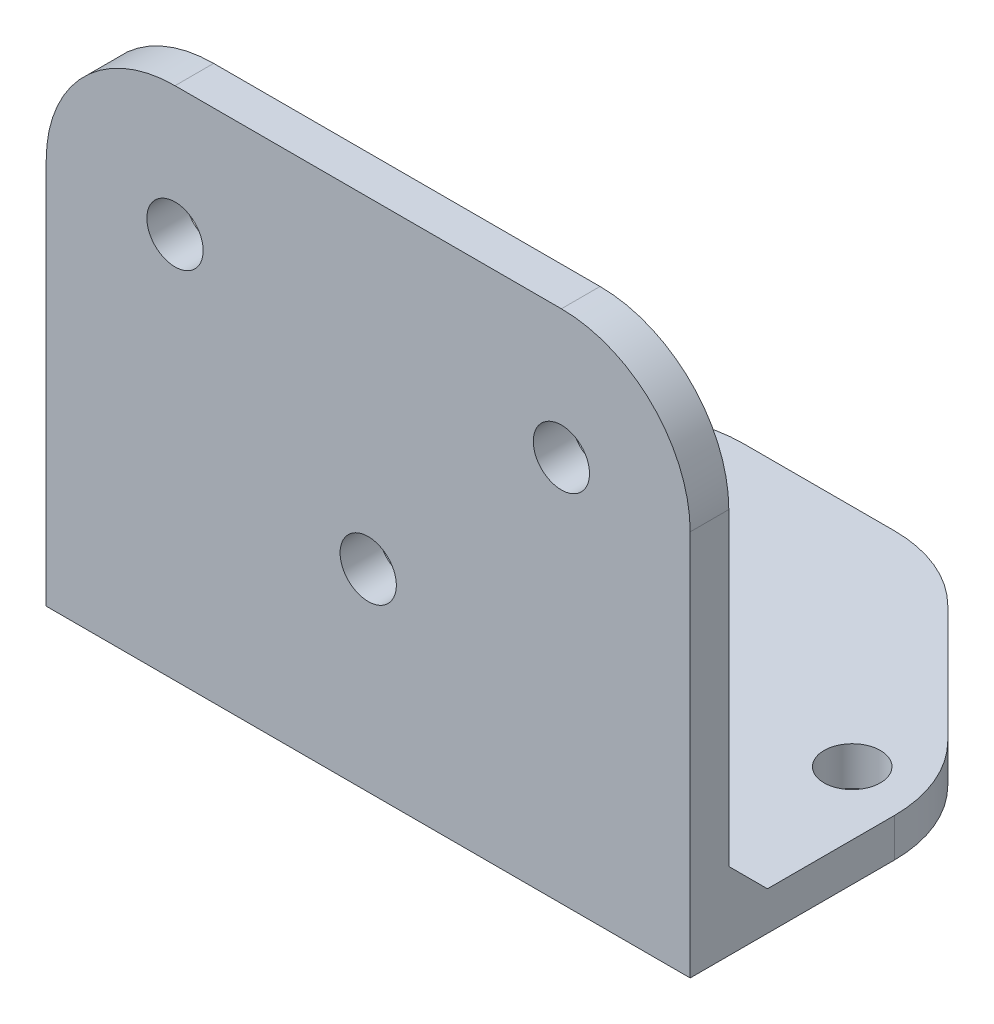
ISO-10303-21;
HEADER;
FILE_DESCRIPTION(('STEP AP214'),'2;1');
FILE_NAME('part.step','',(''),(''),'','','');
FILE_SCHEMA(('AUTOMOTIVE_DESIGN { 1 0 10303 214 1 1 1 1 }'));
ENDSEC;
DATA;
#1=APPLICATION_CONTEXT('core data for automotive mechanical design processes');
#2=APPLICATION_PROTOCOL_DEFINITION('international standard','automotive_design',2000,#1);
#3=PRODUCT_CONTEXT('',#1,'mechanical');
#4=PRODUCT('Part','Part','',(#3));
#5=PRODUCT_RELATED_PRODUCT_CATEGORY('part','',(#4));
#6=PRODUCT_DEFINITION_FORMATION('','',#4);
#7=PRODUCT_DEFINITION_CONTEXT('part definition',#1,'design');
#8=PRODUCT_DEFINITION('design','',#6,#7);
#9=PRODUCT_DEFINITION_SHAPE('','',#8);
#10=(LENGTH_UNIT() NAMED_UNIT(*) SI_UNIT(.MILLI.,.METRE.));
#11=(NAMED_UNIT(*) PLANE_ANGLE_UNIT() SI_UNIT($,.RADIAN.));
#12=(NAMED_UNIT(*) SI_UNIT($,.STERADIAN.) SOLID_ANGLE_UNIT());
#13=UNCERTAINTY_MEASURE_WITH_UNIT(LENGTH_MEASURE(1.E-05),#10,'distance_accuracy_value','');
#14=(GEOMETRIC_REPRESENTATION_CONTEXT(3) GLOBAL_UNCERTAINTY_ASSIGNED_CONTEXT((#13)) GLOBAL_UNIT_ASSIGNED_CONTEXT((#10,
#11,#12)) REPRESENTATION_CONTEXT('',''));
#15=CARTESIAN_POINT('',(0.,0.,0.));
#16=DIRECTION('',(0.,0.,1.));
#17=DIRECTION('',(1.,0.,0.));
#18=AXIS2_PLACEMENT_3D('',#15,#16,#17);
#19=CARTESIAN_POINT('',(0.,3.,0.));
#20=DIRECTION('',(0.,1.,0.));
#21=DIRECTION('',(0.,0.,1.));
#22=AXIS2_PLACEMENT_3D('',#19,#20,#21);
#23=PLANE('',#22);
#24=DIRECTION('',(0.707106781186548,0.,-0.707106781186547));
#25=VECTOR('',#24,1.);
#26=CARTESIAN_POINT('',(-13.75,3.,-13.75));
#27=LINE('',#26,#25);
#28=CARTESIAN_POINT('',(-12.9289321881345,3.,-14.5710678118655));
#29=VERTEX_POINT('',#28);
#30=CARTESIAN_POINT('',(-22.0710678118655,3.,-5.4289321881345));
#31=VERTEX_POINT('',#30);
#32=EDGE_CURVE('E216',#29,#31,#27,.F.);
#33=ORIENTED_EDGE('',*,*,#32,.T.);
#34=CARTESIAN_POINT('',(-15.,3.,1.64213562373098));
#35=DIRECTION('',(0.,1.,0.));
#36=DIRECTION('',(0.,0.,1.));
#37=AXIS2_PLACEMENT_3D('',#34,#35,#36);
#38=CIRCLE('',#37,10.);
#39=CARTESIAN_POINT('',(-25.,3.,1.64213562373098));
#40=VERTEX_POINT('',#39);
#41=EDGE_CURVE('E277',#31,#40,#38,.T.);
#42=ORIENTED_EDGE('',*,*,#41,.T.);
#43=DIRECTION('',(0.,0.,1.));
#44=VECTOR('',#43,1.);
#45=CARTESIAN_POINT('',(-25.,3.,-17.5));
#46=LINE('',#45,#44);
#47=CARTESIAN_POINT('',(-25.,3.,11.5));
#48=VERTEX_POINT('',#47);
#49=EDGE_CURVE('E189',#40,#48,#46,.T.);
#50=ORIENTED_EDGE('',*,*,#49,.T.);
#51=DIRECTION('',(1.,0.,0.));
#52=VECTOR('',#51,1.);
#53=CARTESIAN_POINT('',(25.,3.,11.5));
#54=LINE('',#53,#52);
#55=CARTESIAN_POINT('',(25.,3.,11.5));
#56=VERTEX_POINT('',#55);
#57=EDGE_CURVE('E194',#48,#56,#54,.T.);
#58=ORIENTED_EDGE('',*,*,#57,.T.);
#59=DIRECTION('',(0.,0.,-1.));
#60=VECTOR('',#59,1.);
#61=CARTESIAN_POINT('',(25.,3.,-17.5));
#62=LINE('',#61,#60);
#63=CARTESIAN_POINT('',(25.,3.,1.642135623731));
#64=VERTEX_POINT('',#63);
#65=EDGE_CURVE('E181',#56,#64,#62,.T.);
#66=ORIENTED_EDGE('',*,*,#65,.T.);
#67=CARTESIAN_POINT('',(15.,3.,1.64213562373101));
#68=DIRECTION('',(0.,1.,0.));
#69=DIRECTION('',(0.,0.,1.));
#70=AXIS2_PLACEMENT_3D('',#67,#68,#69);
#71=CIRCLE('',#70,10.);
#72=CARTESIAN_POINT('',(22.0710678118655,3.,-5.42893218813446));
#73=VERTEX_POINT('',#72);
#74=EDGE_CURVE('E64',#64,#73,#71,.T.);
#75=ORIENTED_EDGE('',*,*,#74,.T.);
#76=DIRECTION('',(0.707106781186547,0.,0.707106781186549));
#77=VECTOR('',#76,1.);
#78=CARTESIAN_POINT('',(13.75,3.,-13.75));
#79=LINE('',#78,#77);
#80=CARTESIAN_POINT('',(12.9289321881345,3.,-14.5710678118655));
#81=VERTEX_POINT('',#80);
#82=EDGE_CURVE('E213',#73,#81,#79,.F.);
#83=ORIENTED_EDGE('',*,*,#82,.T.);
#84=CARTESIAN_POINT('',(5.85786437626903,3.,-7.49999999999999));
#85=DIRECTION('',(0.,1.,0.));
#86=DIRECTION('',(0.,0.,1.));
#87=AXIS2_PLACEMENT_3D('',#84,#85,#86);
#88=CIRCLE('',#87,10.);
#89=CARTESIAN_POINT('',(5.85786437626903,3.,-17.5));
#90=VERTEX_POINT('',#89);
#91=EDGE_CURVE('E269',#81,#90,#88,.T.);
#92=ORIENTED_EDGE('',*,*,#91,.T.);
#93=DIRECTION('',(-1.,0.,0.));
#94=VECTOR('',#93,1.);
#95=CARTESIAN_POINT('',(-25.,3.,-17.5));
#96=LINE('',#95,#94);
#97=CARTESIAN_POINT('',(-5.85786437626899,3.,-17.5));
#98=VERTEX_POINT('',#97);
#99=EDGE_CURVE('E184',#90,#98,#96,.T.);
#100=ORIENTED_EDGE('',*,*,#99,.T.);
#101=CARTESIAN_POINT('',(-5.85786437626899,3.,-7.49999999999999));
#102=DIRECTION('',(0.,1.,0.));
#103=DIRECTION('',(0.,0.,1.));
#104=AXIS2_PLACEMENT_3D('',#101,#102,#103);
#105=CIRCLE('',#104,10.);
#106=EDGE_CURVE('E272',#98,#29,#105,.T.);
#107=ORIENTED_EDGE('',*,*,#106,.T.);
#108=EDGE_LOOP('',(#33,#42,#50,#58,#66,#75,#83,#92,#100,#107));
#109=FACE_BOUND('',#108,.T.);
#110=CARTESIAN_POINT('',(-20.0787,3.,0.));
#111=DIRECTION('',(0.,1.,0.));
#112=DIRECTION('',(0.,0.,1.));
#113=AXIS2_PLACEMENT_3D('',#110,#111,#112);
#114=CIRCLE('',#113,2.1844);
#115=CARTESIAN_POINT('',(-20.0787,3.,2.1844));
#116=VERTEX_POINT('',#115);
#117=EDGE_CURVE('E299',#116,#116,#114,.T.);
#118=ORIENTED_EDGE('',*,*,#117,.F.);
#119=EDGE_LOOP('',(#118));
#120=FACE_BOUND('',#119,.T.);
#121=CARTESIAN_POINT('',(20.0787,3.,0.));
#122=DIRECTION('',(0.,1.,0.));
#123=DIRECTION('',(0.,0.,1.));
#124=AXIS2_PLACEMENT_3D('',#121,#122,#123);
#125=CIRCLE('',#124,2.1844);
#126=CARTESIAN_POINT('',(20.0787,3.,2.18439999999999));
#127=VERTEX_POINT('',#126);
#128=EDGE_CURVE('E310',#127,#127,#125,.T.);
#129=ORIENTED_EDGE('',*,*,#128,.F.);
#130=EDGE_LOOP('',(#129));
#131=FACE_BOUND('',#130,.T.);
#132=ADVANCED_FACE('F41',(#109,#120,#131),#23,.T.);
#133=CARTESIAN_POINT('',(0.,0.,0.));
#134=DIRECTION('',(0.,1.,0.));
#135=DIRECTION('',(0.,0.,1.));
#136=AXIS2_PLACEMENT_3D('',#133,#134,#135);
#137=PLANE('',#136);
#138=DIRECTION('',(0.,0.,1.));
#139=VECTOR('',#138,1.);
#140=CARTESIAN_POINT('',(-25.,0.,-17.5));
#141=LINE('',#140,#139);
#142=CARTESIAN_POINT('',(-25.,0.,1.64213562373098));
#143=VERTEX_POINT('',#142);
#144=CARTESIAN_POINT('',(-25.,0.,17.5));
#145=VERTEX_POINT('',#144);
#146=EDGE_CURVE('E151',#143,#145,#141,.T.);
#147=ORIENTED_EDGE('',*,*,#146,.F.);
#148=CARTESIAN_POINT('',(-15.,0.,1.64213562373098));
#149=DIRECTION('',(0.,1.,0.));
#150=DIRECTION('',(0.,0.,1.));
#151=AXIS2_PLACEMENT_3D('',#148,#149,#150);
#152=CIRCLE('',#151,10.);
#153=CARTESIAN_POINT('',(-22.0710678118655,0.,-5.4289321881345));
#154=VERTEX_POINT('',#153);
#155=EDGE_CURVE('E260',#143,#154,#152,.F.);
#156=ORIENTED_EDGE('',*,*,#155,.T.);
#157=DIRECTION('',(-0.707106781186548,0.,0.707106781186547));
#158=VECTOR('',#157,1.);
#159=CARTESIAN_POINT('',(-25.,0.,-2.49999999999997));
#160=LINE('',#159,#158);
#161=CARTESIAN_POINT('',(-12.9289321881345,0.,-14.5710678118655));
#162=VERTEX_POINT('',#161);
#163=EDGE_CURVE('E209',#154,#162,#160,.F.);
#164=ORIENTED_EDGE('',*,*,#163,.T.);
#165=CARTESIAN_POINT('',(-5.85786437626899,0.,-7.49999999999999));
#166=DIRECTION('',(0.,1.,0.));
#167=DIRECTION('',(0.,0.,1.));
#168=AXIS2_PLACEMENT_3D('',#165,#166,#167);
#169=CIRCLE('',#168,10.);
#170=CARTESIAN_POINT('',(-5.85786437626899,0.,-17.5));
#171=VERTEX_POINT('',#170);
#172=EDGE_CURVE('E254',#162,#171,#169,.F.);
#173=ORIENTED_EDGE('',*,*,#172,.T.);
#174=DIRECTION('',(-1.,0.,0.));
#175=VECTOR('',#174,1.);
#176=CARTESIAN_POINT('',(-25.,0.,-17.5));
#177=LINE('',#176,#175);
#178=CARTESIAN_POINT('',(5.85786437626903,0.,-17.5));
#179=VERTEX_POINT('',#178);
#180=EDGE_CURVE('E163',#179,#171,#177,.T.);
#181=ORIENTED_EDGE('',*,*,#180,.F.);
#182=CARTESIAN_POINT('',(5.85786437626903,0.,-7.49999999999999));
#183=DIRECTION('',(0.,1.,0.));
#184=DIRECTION('',(0.,0.,1.));
#185=AXIS2_PLACEMENT_3D('',#182,#183,#184);
#186=CIRCLE('',#185,10.);
#187=CARTESIAN_POINT('',(12.9289321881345,0.,-14.5710678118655));
#188=VERTEX_POINT('',#187);
#189=EDGE_CURVE('E251',#179,#188,#186,.F.);
#190=ORIENTED_EDGE('',*,*,#189,.T.);
#191=DIRECTION('',(-0.707106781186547,0.,-0.707106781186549));
#192=VECTOR('',#191,1.);
#193=CARTESIAN_POINT('',(9.99999999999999,0.,-17.5));
#194=LINE('',#193,#192);
#195=CARTESIAN_POINT('',(22.0710678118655,0.,-5.42893218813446));
#196=VERTEX_POINT('',#195);
#197=EDGE_CURVE('E205',#188,#196,#194,.F.);
#198=ORIENTED_EDGE('',*,*,#197,.T.);
#199=CARTESIAN_POINT('',(15.,0.,1.64213562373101));
#200=DIRECTION('',(0.,1.,0.));
#201=DIRECTION('',(0.,0.,1.));
#202=AXIS2_PLACEMENT_3D('',#199,#200,#201);
#203=CIRCLE('',#202,10.);
#204=CARTESIAN_POINT('',(25.,0.,1.642135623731));
#205=VERTEX_POINT('',#204);
#206=EDGE_CURVE('E257',#196,#205,#203,.F.);
#207=ORIENTED_EDGE('',*,*,#206,.T.);
#208=DIRECTION('',(0.,0.,-1.));
#209=VECTOR('',#208,1.);
#210=CARTESIAN_POINT('',(25.,0.,-17.5));
#211=LINE('',#210,#209);
#212=CARTESIAN_POINT('',(25.,0.,17.5));
#213=VERTEX_POINT('',#212);
#214=EDGE_CURVE('E179',#213,#205,#211,.T.);
#215=ORIENTED_EDGE('',*,*,#214,.F.);
#216=DIRECTION('',(1.,0.,0.));
#217=VECTOR('',#216,1.);
#218=CARTESIAN_POINT('',(-25.,0.,17.5));
#219=LINE('',#218,#217);
#220=EDGE_CURVE('E162',#145,#213,#219,.T.);
#221=ORIENTED_EDGE('',*,*,#220,.F.);
#222=EDGE_LOOP('',(#147,#156,#164,#173,#181,#190,#198,#207,#215,#221));
#223=FACE_BOUND('',#222,.T.);
#224=CARTESIAN_POINT('',(-20.0787,0.,0.));
#225=DIRECTION('',(0.,1.,0.));
#226=DIRECTION('',(0.,0.,1.));
#227=AXIS2_PLACEMENT_3D('',#224,#225,#226);
#228=CIRCLE('',#227,2.1844);
#229=CARTESIAN_POINT('',(-20.0787,0.,2.1844));
#230=VERTEX_POINT('',#229);
#231=EDGE_CURVE('E306',#230,#230,#228,.T.);
#232=ORIENTED_EDGE('',*,*,#231,.T.);
#233=EDGE_LOOP('',(#232));
#234=FACE_BOUND('',#233,.T.);
#235=CARTESIAN_POINT('',(20.0787,0.,0.));
#236=DIRECTION('',(0.,1.,0.));
#237=DIRECTION('',(0.,0.,1.));
#238=AXIS2_PLACEMENT_3D('',#235,#236,#237);
#239=CIRCLE('',#238,2.1844);
#240=CARTESIAN_POINT('',(20.0787,0.,2.18439999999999));
#241=VERTEX_POINT('',#240);
#242=EDGE_CURVE('E314',#241,#241,#239,.T.);
#243=ORIENTED_EDGE('',*,*,#242,.T.);
#244=EDGE_LOOP('',(#243));
#245=FACE_BOUND('',#244,.T.);
#246=ADVANCED_FACE('F176',(#223,#234,#245),#137,.F.);
#247=CARTESIAN_POINT('',(25.,3.,-17.5));
#248=DIRECTION('',(-1.,0.,0.));
#249=DIRECTION('',(0.,0.,1.));
#250=AXIS2_PLACEMENT_3D('',#247,#248,#249);
#251=PLANE('',#250);
#252=DIRECTION('',(0.,-1.,0.));
#253=VECTOR('',#252,1.);
#254=CARTESIAN_POINT('',(25.,40.,14.5));
#255=LINE('',#254,#253);
#256=CARTESIAN_POINT('',(25.,30.,14.5));
#257=VERTEX_POINT('',#256);
#258=CARTESIAN_POINT('',(25.,6.00000000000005,14.5));
#259=VERTEX_POINT('',#258);
#260=EDGE_CURVE('E322',#257,#259,#255,.T.);
#261=ORIENTED_EDGE('',*,*,#260,.F.);
#262=DIRECTION('',(0.,0.,-1.));
#263=VECTOR('',#262,1.);
#264=CARTESIAN_POINT('',(25.,30.,17.5));
#265=LINE('',#264,#263);
#266=CARTESIAN_POINT('',(25.,30.,17.5));
#267=VERTEX_POINT('',#266);
#268=EDGE_CURVE('E248',#257,#267,#265,.F.);
#269=ORIENTED_EDGE('',*,*,#268,.T.);
#270=DIRECTION('',(0.,-1.,0.));
#271=VECTOR('',#270,1.);
#272=CARTESIAN_POINT('',(25.,3.,17.5));
#273=LINE('',#272,#271);
#274=EDGE_CURVE('E174',#267,#213,#273,.T.);
#275=ORIENTED_EDGE('',*,*,#274,.T.);
#276=ORIENTED_EDGE('',*,*,#214,.T.);
#277=DIRECTION('',(0.,-1.,0.));
#278=VECTOR('',#277,1.);
#279=CARTESIAN_POINT('',(25.,3.,1.64213562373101));
#280=LINE('',#279,#278);
#281=EDGE_CURVE('E244',#205,#64,#280,.F.);
#282=ORIENTED_EDGE('',*,*,#281,.T.);
#283=ORIENTED_EDGE('',*,*,#65,.F.);
#284=DIRECTION('',(0.,-0.707106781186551,-0.707106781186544));
#285=VECTOR('',#284,1.);
#286=CARTESIAN_POINT('',(25.,-11.5,-2.99999999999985));
#287=LINE('',#286,#285);
#288=EDGE_CURVE('E201',#56,#259,#287,.F.);
#289=ORIENTED_EDGE('',*,*,#288,.T.);
#290=EDGE_LOOP('',(#261,#269,#275,#276,#282,#283,#289));
#291=FACE_BOUND('',#290,.T.);
#292=ADVANCED_FACE('F396',(#291),#251,.F.);
#293=CARTESIAN_POINT('',(-25.,3.,-17.5));
#294=DIRECTION('',(0.,0.,1.));
#295=DIRECTION('',(1.,0.,0.));
#296=AXIS2_PLACEMENT_3D('',#293,#294,#295);
#297=PLANE('',#296);
#298=ORIENTED_EDGE('',*,*,#180,.T.);
#299=DIRECTION('',(0.,-1.,0.));
#300=VECTOR('',#299,1.);
#301=CARTESIAN_POINT('',(-5.85786437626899,3.,-17.5));
#302=LINE('',#301,#300);
#303=EDGE_CURVE('E11',#171,#98,#302,.F.);
#304=ORIENTED_EDGE('',*,*,#303,.T.);
#305=ORIENTED_EDGE('',*,*,#99,.F.);
#306=DIRECTION('',(0.,1.,0.));
#307=VECTOR('',#306,1.);
#308=CARTESIAN_POINT('',(5.85786437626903,0.,-17.5));
#309=LINE('',#308,#307);
#310=EDGE_CURVE('E50',#90,#179,#309,.F.);
#311=ORIENTED_EDGE('',*,*,#310,.T.);
#312=EDGE_LOOP('',(#298,#304,#305,#311));
#313=FACE_BOUND('',#312,.T.);
#314=ADVANCED_FACE('F291',(#313),#297,.F.);
#315=CARTESIAN_POINT('',(-25.,3.,-17.5));
#316=DIRECTION('',(1.,0.,0.));
#317=DIRECTION('',(0.,0.,-1.));
#318=AXIS2_PLACEMENT_3D('',#315,#316,#317);
#319=PLANE('',#318);
#320=DIRECTION('',(0.,-1.,0.));
#321=VECTOR('',#320,1.);
#322=CARTESIAN_POINT('',(-25.,3.,17.5));
#323=LINE('',#322,#321);
#324=CARTESIAN_POINT('',(-25.,30.,17.5));
#325=VERTEX_POINT('',#324);
#326=EDGE_CURVE('E154',#325,#145,#323,.T.);
#327=ORIENTED_EDGE('',*,*,#326,.F.);
#328=DIRECTION('',(0.,0.,1.));
#329=VECTOR('',#328,1.);
#330=CARTESIAN_POINT('',(-25.,30.,14.5));
#331=LINE('',#330,#329);
#332=CARTESIAN_POINT('',(-25.,30.,14.5));
#333=VERTEX_POINT('',#332);
#334=EDGE_CURVE('E235',#325,#333,#331,.F.);
#335=ORIENTED_EDGE('',*,*,#334,.T.);
#336=DIRECTION('',(0.,-1.,0.));
#337=VECTOR('',#336,1.);
#338=CARTESIAN_POINT('',(-25.,40.,14.5));
#339=LINE('',#338,#337);
#340=CARTESIAN_POINT('',(-25.,6.00000000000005,14.5));
#341=VERTEX_POINT('',#340);
#342=EDGE_CURVE('E318',#333,#341,#339,.T.);
#343=ORIENTED_EDGE('',*,*,#342,.T.);
#344=DIRECTION('',(0.,0.707106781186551,0.707106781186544));
#345=VECTOR('',#344,1.);
#346=CARTESIAN_POINT('',(-25.,-11.5,-2.99999999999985));
#347=LINE('',#346,#345);
#348=EDGE_CURVE('E197',#341,#48,#347,.F.);
#349=ORIENTED_EDGE('',*,*,#348,.T.);
#350=ORIENTED_EDGE('',*,*,#49,.F.);
#351=DIRECTION('',(0.,1.,0.));
#352=VECTOR('',#351,1.);
#353=CARTESIAN_POINT('',(-25.,0.,1.64213562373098));
#354=LINE('',#353,#352);
#355=EDGE_CURVE('E158',#40,#143,#354,.F.);
#356=ORIENTED_EDGE('',*,*,#355,.T.);
#357=ORIENTED_EDGE('',*,*,#146,.T.);
#358=EDGE_LOOP('',(#327,#335,#343,#349,#350,#356,#357));
#359=FACE_BOUND('',#358,.T.);
#360=ADVANCED_FACE('F153',(#359),#319,.F.);
#361=CARTESIAN_POINT('',(-25.,3.,17.5));
#362=DIRECTION('',(0.,0.,-1.));
#363=DIRECTION('',(-1.,0.,0.));
#364=AXIS2_PLACEMENT_3D('',#361,#362,#363);
#365=PLANE('',#364);
#366=CARTESIAN_POINT('',(-15.,30.,17.5));
#367=DIRECTION('',(0.,0.,-1.));
#368=DIRECTION('',(-1.,0.,0.));
#369=AXIS2_PLACEMENT_3D('',#366,#367,#368);
#370=CIRCLE('',#369,2.1844);
#371=CARTESIAN_POINT('',(-17.1844,30.,17.5));
#372=VERTEX_POINT('',#371);
#373=EDGE_CURVE('E335',#372,#372,#370,.T.);
#374=ORIENTED_EDGE('',*,*,#373,.T.);
#375=EDGE_LOOP('',(#374));
#376=FACE_BOUND('',#375,.T.);
#377=CARTESIAN_POINT('',(15.,29.9999999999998,17.5));
#378=DIRECTION('',(0.,0.,-1.));
#379=DIRECTION('',(-1.,0.,0.));
#380=AXIS2_PLACEMENT_3D('',#377,#378,#379);
#381=CIRCLE('',#380,2.1844);
#382=CARTESIAN_POINT('',(12.8156,29.9999999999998,17.5));
#383=VERTEX_POINT('',#382);
#384=EDGE_CURVE('E348',#383,#383,#381,.T.);
#385=ORIENTED_EDGE('',*,*,#384,.T.);
#386=EDGE_LOOP('',(#385));
#387=FACE_BOUND('',#386,.T.);
#388=CARTESIAN_POINT('',(-3.68489960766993E-13,14.9999999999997,17.5));
#389=DIRECTION('',(0.,0.,-1.));
#390=DIRECTION('',(-1.,0.,0.));
#391=AXIS2_PLACEMENT_3D('',#388,#389,#390);
#392=CIRCLE('',#391,2.1844);
#393=CARTESIAN_POINT('',(-2.18440000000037,14.9999999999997,17.5));
#394=VERTEX_POINT('',#393);
#395=EDGE_CURVE('E340',#394,#394,#392,.T.);
#396=ORIENTED_EDGE('',*,*,#395,.T.);
#397=EDGE_LOOP('',(#396));
#398=FACE_BOUND('',#397,.T.);
#399=DIRECTION('',(1.,0.,0.));
#400=VECTOR('',#399,1.);
#401=CARTESIAN_POINT('',(-25.,40.,17.5));
#402=LINE('',#401,#400);
#403=CARTESIAN_POINT('',(-15.,40.,17.5));
#404=VERTEX_POINT('',#403);
#405=CARTESIAN_POINT('',(15.,40.,17.5));
#406=VERTEX_POINT('',#405);
#407=EDGE_CURVE('E325',#404,#406,#402,.T.);
#408=ORIENTED_EDGE('',*,*,#407,.F.);
#409=CARTESIAN_POINT('',(-15.,30.,17.5));
#410=DIRECTION('',(0.,0.,-1.));
#411=DIRECTION('',(-1.,0.,0.));
#412=AXIS2_PLACEMENT_3D('',#409,#410,#411);
#413=CIRCLE('',#412,10.);
#414=EDGE_CURVE('E171',#404,#325,#413,.F.);
#415=ORIENTED_EDGE('',*,*,#414,.T.);
#416=ORIENTED_EDGE('',*,*,#326,.T.);
#417=ORIENTED_EDGE('',*,*,#220,.T.);
#418=ORIENTED_EDGE('',*,*,#274,.F.);
#419=CARTESIAN_POINT('',(15.,30.,17.5));
#420=DIRECTION('',(0.,0.,-1.));
#421=DIRECTION('',(-1.,0.,0.));
#422=AXIS2_PLACEMENT_3D('',#419,#420,#421);
#423=CIRCLE('',#422,10.);
#424=EDGE_CURVE('E228',#267,#406,#423,.F.);
#425=ORIENTED_EDGE('',*,*,#424,.T.);
#426=EDGE_LOOP('',(#408,#415,#416,#417,#418,#425));
#427=FACE_BOUND('',#426,.T.);
#428=ADVANCED_FACE('F168',(#376,#387,#398,#427),#365,.F.);
#429=CARTESIAN_POINT('',(-20.0787,3.,0.));
#430=DIRECTION('',(0.,-1.,0.));
#431=DIRECTION('',(0.,0.,-1.));
#432=AXIS2_PLACEMENT_3D('',#429,#430,#431);
#433=CYLINDRICAL_SURFACE('',#432,2.1844);
#434=ORIENTED_EDGE('',*,*,#117,.T.);
#435=EDGE_LOOP('',(#434));
#436=FACE_BOUND('',#435,.T.);
#437=ORIENTED_EDGE('',*,*,#231,.F.);
#438=EDGE_LOOP('',(#437));
#439=FACE_BOUND('',#438,.T.);
#440=ADVANCED_FACE('F425',(#436,#439),#433,.F.);
#441=CARTESIAN_POINT('',(20.0787,3.,0.));
#442=DIRECTION('',(0.,-1.,0.));
#443=DIRECTION('',(0.,0.,-1.));
#444=AXIS2_PLACEMENT_3D('',#441,#442,#443);
#445=CYLINDRICAL_SURFACE('',#444,2.1844);
#446=ORIENTED_EDGE('',*,*,#128,.T.);
#447=EDGE_LOOP('',(#446));
#448=FACE_BOUND('',#447,.T.);
#449=ORIENTED_EDGE('',*,*,#242,.F.);
#450=EDGE_LOOP('',(#449));
#451=FACE_BOUND('',#450,.T.);
#452=ADVANCED_FACE('F374',(#448,#451),#445,.F.);
#453=CARTESIAN_POINT('',(-25.,40.,14.5));
#454=DIRECTION('',(0.,0.,-1.));
#455=DIRECTION('',(-1.,0.,0.));
#456=AXIS2_PLACEMENT_3D('',#453,#454,#455);
#457=PLANE('',#456);
#458=CARTESIAN_POINT('',(-15.,30.,14.5));
#459=DIRECTION('',(0.,0.,-1.));
#460=DIRECTION('',(-1.,0.,0.));
#461=AXIS2_PLACEMENT_3D('',#458,#459,#460);
#462=CIRCLE('',#461,2.1844);
#463=CARTESIAN_POINT('',(-17.1844,30.,14.5));
#464=VERTEX_POINT('',#463);
#465=EDGE_CURVE('E352',#464,#464,#462,.T.);
#466=ORIENTED_EDGE('',*,*,#465,.F.);
#467=EDGE_LOOP('',(#466));
#468=FACE_BOUND('',#467,.T.);
#469=CARTESIAN_POINT('',(15.,29.9999999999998,14.5));
#470=DIRECTION('',(0.,0.,-1.));
#471=DIRECTION('',(-1.,0.,0.));
#472=AXIS2_PLACEMENT_3D('',#469,#470,#471);
#473=CIRCLE('',#472,2.1844);
#474=CARTESIAN_POINT('',(12.8156,29.9999999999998,14.5));
#475=VERTEX_POINT('',#474);
#476=EDGE_CURVE('E344',#475,#475,#473,.T.);
#477=ORIENTED_EDGE('',*,*,#476,.F.);
#478=EDGE_LOOP('',(#477));
#479=FACE_BOUND('',#478,.T.);
#480=CARTESIAN_POINT('',(-3.68489960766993E-13,14.9999999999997,14.5));
#481=DIRECTION('',(0.,0.,-1.));
#482=DIRECTION('',(-1.,0.,0.));
#483=AXIS2_PLACEMENT_3D('',#480,#481,#482);
#484=CIRCLE('',#483,2.1844);
#485=CARTESIAN_POINT('',(-2.18440000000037,14.9999999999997,14.5));
#486=VERTEX_POINT('',#485);
#487=EDGE_CURVE('E336',#486,#486,#484,.T.);
#488=ORIENTED_EDGE('',*,*,#487,.F.);
#489=EDGE_LOOP('',(#488));
#490=FACE_BOUND('',#489,.T.);
#491=ORIENTED_EDGE('',*,*,#342,.F.);
#492=CARTESIAN_POINT('',(-15.,30.,14.5));
#493=DIRECTION('',(0.,0.,-1.));
#494=DIRECTION('',(-1.,0.,0.));
#495=AXIS2_PLACEMENT_3D('',#492,#493,#494);
#496=CIRCLE('',#495,10.);
#497=CARTESIAN_POINT('',(-15.,40.,14.5));
#498=VERTEX_POINT('',#497);
#499=EDGE_CURVE('E241',#333,#498,#496,.T.);
#500=ORIENTED_EDGE('',*,*,#499,.T.);
#501=DIRECTION('',(1.,0.,0.));
#502=VECTOR('',#501,1.);
#503=CARTESIAN_POINT('',(-25.,40.,14.5));
#504=LINE('',#503,#502);
#505=CARTESIAN_POINT('',(15.,40.,14.5));
#506=VERTEX_POINT('',#505);
#507=EDGE_CURVE('E331',#498,#506,#504,.T.);
#508=ORIENTED_EDGE('',*,*,#507,.T.);
#509=CARTESIAN_POINT('',(15.,30.,14.5));
#510=DIRECTION('',(0.,0.,-1.));
#511=DIRECTION('',(-1.,0.,0.));
#512=AXIS2_PLACEMENT_3D('',#509,#510,#511);
#513=CIRCLE('',#512,10.);
#514=EDGE_CURVE('E238',#506,#257,#513,.T.);
#515=ORIENTED_EDGE('',*,*,#514,.T.);
#516=ORIENTED_EDGE('',*,*,#260,.T.);
#517=DIRECTION('',(-1.,0.,0.));
#518=VECTOR('',#517,1.);
#519=CARTESIAN_POINT('',(-25.,6.00000000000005,14.5));
#520=LINE('',#519,#518);
#521=EDGE_CURVE('E173',#259,#341,#520,.T.);
#522=ORIENTED_EDGE('',*,*,#521,.T.);
#523=EDGE_LOOP('',(#491,#500,#508,#515,#516,#522));
#524=FACE_BOUND('',#523,.T.);
#525=ADVANCED_FACE('F370',(#468,#479,#490,#524),#457,.T.);
#526=CARTESIAN_POINT('',(0.,40.,0.));
#527=DIRECTION('',(0.,1.,0.));
#528=DIRECTION('',(-1.,0.,0.));
#529=AXIS2_PLACEMENT_3D('',#526,#527,#528);
#530=PLANE('',#529);
#531=ORIENTED_EDGE('',*,*,#507,.F.);
#532=DIRECTION('',(0.,0.,1.));
#533=VECTOR('',#532,1.);
#534=CARTESIAN_POINT('',(-15.,40.,17.5));
#535=LINE('',#534,#533);
#536=EDGE_CURVE('E224',#498,#404,#535,.T.);
#537=ORIENTED_EDGE('',*,*,#536,.T.);
#538=ORIENTED_EDGE('',*,*,#407,.T.);
#539=DIRECTION('',(0.,0.,-1.));
#540=VECTOR('',#539,1.);
#541=CARTESIAN_POINT('',(15.,40.,14.5));
#542=LINE('',#541,#540);
#543=EDGE_CURVE('E220',#406,#506,#542,.T.);
#544=ORIENTED_EDGE('',*,*,#543,.T.);
#545=EDGE_LOOP('',(#531,#537,#538,#544));
#546=FACE_BOUND('',#545,.T.);
#547=ADVANCED_FACE('F373',(#546),#530,.T.);
#548=CARTESIAN_POINT('',(-3.68489960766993E-13,14.9999999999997,17.5));
#549=DIRECTION('',(0.,0.,-1.));
#550=DIRECTION('',(-1.,0.,0.));
#551=AXIS2_PLACEMENT_3D('',#548,#549,#550);
#552=CYLINDRICAL_SURFACE('',#551,2.1844);
#553=ORIENTED_EDGE('',*,*,#395,.F.);
#554=EDGE_LOOP('',(#553));
#555=FACE_BOUND('',#554,.T.);
#556=ORIENTED_EDGE('',*,*,#487,.T.);
#557=EDGE_LOOP('',(#556));
#558=FACE_BOUND('',#557,.T.);
#559=ADVANCED_FACE('F522',(#555,#558),#552,.F.);
#560=CARTESIAN_POINT('',(15.,29.9999999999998,17.5));
#561=DIRECTION('',(0.,0.,-1.));
#562=DIRECTION('',(-1.,0.,0.));
#563=AXIS2_PLACEMENT_3D('',#560,#561,#562);
#564=CYLINDRICAL_SURFACE('',#563,2.1844);
#565=ORIENTED_EDGE('',*,*,#384,.F.);
#566=EDGE_LOOP('',(#565));
#567=FACE_BOUND('',#566,.T.);
#568=ORIENTED_EDGE('',*,*,#476,.T.);
#569=EDGE_LOOP('',(#568));
#570=FACE_BOUND('',#569,.T.);
#571=ADVANCED_FACE('F366',(#567,#570),#564,.F.);
#572=CARTESIAN_POINT('',(-15.,30.,17.5));
#573=DIRECTION('',(0.,0.,-1.));
#574=DIRECTION('',(-1.,0.,0.));
#575=AXIS2_PLACEMENT_3D('',#572,#573,#574);
#576=CYLINDRICAL_SURFACE('',#575,2.1844);
#577=ORIENTED_EDGE('',*,*,#373,.F.);
#578=EDGE_LOOP('',(#577));
#579=FACE_BOUND('',#578,.T.);
#580=ORIENTED_EDGE('',*,*,#465,.T.);
#581=EDGE_LOOP('',(#580));
#582=FACE_BOUND('',#581,.T.);
#583=ADVANCED_FACE('F362',(#579,#582),#576,.F.);
#584=CARTESIAN_POINT('',(-25.,6.00000000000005,14.5));
#585=DIRECTION('',(0.,0.707106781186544,-0.707106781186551));
#586=DIRECTION('',(1.,0.,0.));
#587=AXIS2_PLACEMENT_3D('',#584,#585,#586);
#588=PLANE('',#587);
#589=ORIENTED_EDGE('',*,*,#288,.F.);
#590=ORIENTED_EDGE('',*,*,#57,.F.);
#591=ORIENTED_EDGE('',*,*,#348,.F.);
#592=ORIENTED_EDGE('',*,*,#521,.F.);
#593=EDGE_LOOP('',(#589,#590,#591,#592));
#594=FACE_BOUND('',#593,.T.);
#595=ADVANCED_FACE('F365',(#594),#588,.T.);
#596=CARTESIAN_POINT('',(-25.,3.,-2.49999999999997));
#597=DIRECTION('',(0.707106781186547,0.,0.707106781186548));
#598=DIRECTION('',(0.,-1.,0.));
#599=AXIS2_PLACEMENT_3D('',#596,#597,#598);
#600=PLANE('',#599);
#601=ORIENTED_EDGE('',*,*,#163,.F.);
#602=DIRECTION('',(0.,-1.,0.));
#603=VECTOR('',#602,1.);
#604=CARTESIAN_POINT('',(-22.0710678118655,3.,-5.4289321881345));
#605=LINE('',#604,#603);
#606=EDGE_CURVE('E266',#154,#31,#605,.F.);
#607=ORIENTED_EDGE('',*,*,#606,.T.);
#608=ORIENTED_EDGE('',*,*,#32,.F.);
#609=DIRECTION('',(0.,1.,0.));
#610=VECTOR('',#609,1.);
#611=CARTESIAN_POINT('',(-12.9289321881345,0.,-14.5710678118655));
#612=LINE('',#611,#610);
#613=EDGE_CURVE('E263',#29,#162,#612,.F.);
#614=ORIENTED_EDGE('',*,*,#613,.T.);
#615=EDGE_LOOP('',(#601,#607,#608,#614));
#616=FACE_BOUND('',#615,.T.);
#617=ADVANCED_FACE('F407',(#616),#600,.F.);
#618=CARTESIAN_POINT('',(9.99999999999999,3.,-17.5));
#619=DIRECTION('',(-0.707106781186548,0.,0.707106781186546));
#620=DIRECTION('',(0.,-1.,0.));
#621=AXIS2_PLACEMENT_3D('',#618,#619,#620);
#622=PLANE('',#621);
#623=ORIENTED_EDGE('',*,*,#82,.F.);
#624=DIRECTION('',(0.,1.,0.));
#625=VECTOR('',#624,1.);
#626=CARTESIAN_POINT('',(22.0710678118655,0.,-5.42893218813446));
#627=LINE('',#626,#625);
#628=EDGE_CURVE('E282',#73,#196,#627,.F.);
#629=ORIENTED_EDGE('',*,*,#628,.T.);
#630=ORIENTED_EDGE('',*,*,#197,.F.);
#631=DIRECTION('',(0.,-1.,0.));
#632=VECTOR('',#631,1.);
#633=CARTESIAN_POINT('',(12.9289321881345,3.,-14.5710678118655));
#634=LINE('',#633,#632);
#635=EDGE_CURVE('E57',#188,#81,#634,.F.);
#636=ORIENTED_EDGE('',*,*,#635,.T.);
#637=EDGE_LOOP('',(#623,#629,#630,#636));
#638=FACE_BOUND('',#637,.T.);
#639=ADVANCED_FACE('F447',(#638),#622,.F.);
#640=CARTESIAN_POINT('',(-15.,30.,0.));
#641=DIRECTION('',(0.,0.,-1.));
#642=DIRECTION('',(-1.,0.,0.));
#643=AXIS2_PLACEMENT_3D('',#640,#641,#642);
#644=CYLINDRICAL_SURFACE('',#643,10.);
#645=ORIENTED_EDGE('',*,*,#499,.F.);
#646=ORIENTED_EDGE('',*,*,#334,.F.);
#647=ORIENTED_EDGE('',*,*,#414,.F.);
#648=ORIENTED_EDGE('',*,*,#536,.F.);
#649=EDGE_LOOP('',(#645,#646,#647,#648));
#650=FACE_BOUND('',#649,.T.);
#651=ADVANCED_FACE('F387',(#650),#644,.T.);
#652=CARTESIAN_POINT('',(15.,30.,0.));
#653=DIRECTION('',(0.,0.,1.));
#654=DIRECTION('',(1.,0.,0.));
#655=AXIS2_PLACEMENT_3D('',#652,#653,#654);
#656=CYLINDRICAL_SURFACE('',#655,10.);
#657=ORIENTED_EDGE('',*,*,#424,.F.);
#658=ORIENTED_EDGE('',*,*,#268,.F.);
#659=ORIENTED_EDGE('',*,*,#514,.F.);
#660=ORIENTED_EDGE('',*,*,#543,.F.);
#661=EDGE_LOOP('',(#657,#658,#659,#660));
#662=FACE_BOUND('',#661,.T.);
#663=ADVANCED_FACE('F393',(#662),#656,.T.);
#664=CARTESIAN_POINT('',(-15.,3.,1.64213562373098));
#665=DIRECTION('',(0.,-1.,0.));
#666=DIRECTION('',(0.,0.,-1.));
#667=AXIS2_PLACEMENT_3D('',#664,#665,#666);
#668=CYLINDRICAL_SURFACE('',#667,10.);
#669=ORIENTED_EDGE('',*,*,#41,.F.);
#670=ORIENTED_EDGE('',*,*,#606,.F.);
#671=ORIENTED_EDGE('',*,*,#155,.F.);
#672=ORIENTED_EDGE('',*,*,#355,.F.);
#673=EDGE_LOOP('',(#669,#670,#671,#672));
#674=FACE_BOUND('',#673,.T.);
#675=ADVANCED_FACE('F403',(#674),#668,.T.);
#676=CARTESIAN_POINT('',(15.,3.,1.64213562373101));
#677=DIRECTION('',(0.,1.,0.));
#678=DIRECTION('',(0.,0.,1.));
#679=AXIS2_PLACEMENT_3D('',#676,#677,#678);
#680=CYLINDRICAL_SURFACE('',#679,10.);
#681=ORIENTED_EDGE('',*,*,#206,.F.);
#682=ORIENTED_EDGE('',*,*,#628,.F.);
#683=ORIENTED_EDGE('',*,*,#74,.F.);
#684=ORIENTED_EDGE('',*,*,#281,.F.);
#685=EDGE_LOOP('',(#681,#682,#683,#684));
#686=FACE_BOUND('',#685,.T.);
#687=ADVANCED_FACE('F417',(#686),#680,.T.);
#688=CARTESIAN_POINT('',(-5.85786437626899,3.,-7.49999999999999));
#689=DIRECTION('',(0.,1.,0.));
#690=DIRECTION('',(0.,0.,1.));
#691=AXIS2_PLACEMENT_3D('',#688,#689,#690);
#692=CYLINDRICAL_SURFACE('',#691,10.);
#693=ORIENTED_EDGE('',*,*,#172,.F.);
#694=ORIENTED_EDGE('',*,*,#613,.F.);
#695=ORIENTED_EDGE('',*,*,#106,.F.);
#696=ORIENTED_EDGE('',*,*,#303,.F.);
#697=EDGE_LOOP('',(#693,#694,#695,#696));
#698=FACE_BOUND('',#697,.T.);
#699=ADVANCED_FACE('F411',(#698),#692,.T.);
#700=CARTESIAN_POINT('',(5.85786437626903,3.,-7.49999999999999));
#701=DIRECTION('',(0.,-1.,0.));
#702=DIRECTION('',(0.,0.,-1.));
#703=AXIS2_PLACEMENT_3D('',#700,#701,#702);
#704=CYLINDRICAL_SURFACE('',#703,10.);
#705=ORIENTED_EDGE('',*,*,#91,.F.);
#706=ORIENTED_EDGE('',*,*,#635,.F.);
#707=ORIENTED_EDGE('',*,*,#189,.F.);
#708=ORIENTED_EDGE('',*,*,#310,.F.);
#709=EDGE_LOOP('',(#705,#706,#707,#708));
#710=FACE_BOUND('',#709,.T.);
#711=ADVANCED_FACE('F43',(#710),#704,.T.);
#712=CLOSED_SHELL('',(#132,#246,#292,#314,#360,#428,#440,#452,#525,#547,#559,#571,#583,#595,
#617,#639,#651,#663,#675,#687,#699,#711));
#713=MANIFOLD_SOLID_BREP('B2',#712);
#714=ADVANCED_BREP_SHAPE_REPRESENTATION('',(#18,#713),#14);
#715=SHAPE_DEFINITION_REPRESENTATION(#9,#714);
ENDSEC;
END-ISO-10303-21;
